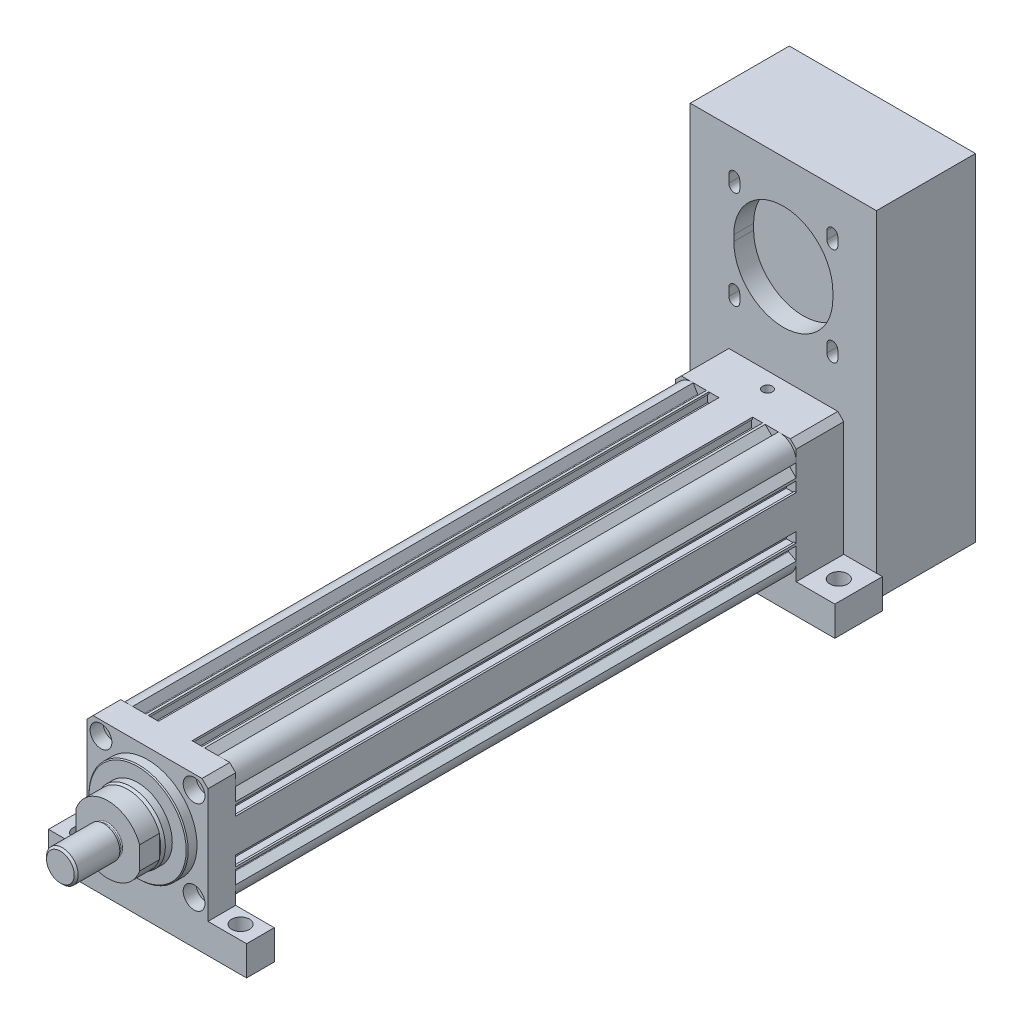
from build123d import *

# Parameters (mm, degrees)
SKETCH_1_R           = 25
SKETCH_1_R_2         = 2.594
EXTRUDE_1_DEPTH      = 283
EXTRUDE_1_2_DEPTH    = 14
SKETCH_3_R           = 4.5
SKETCH_3_R_2         = 3.5
CUT_EXTRUDE_3_DEPTH  = 14
SKETCH_3_5_R         = 5.5
CUT_EXTRUDE_4_DEPTH  = 6.5
SKETCH_5_R           = 25
EXTRUDE_2_DEPTH      = 5
CHAMFER_1_SIZE       = 0.5
SKETCH_6_R           = 17.5
EXTRUDE_3_DEPTH      = 5
CHAMFER_2_SIZE       = 1.5
CHAMFER_2_SIZE2      = 0.8
EXTRUDE_4_DEPTH      = 10
SKETCH_8_R           = 7
EXTRUDE_5_DEPTH      = 2
SKETCH_9_R           = 8
EXTRUDE_6_DEPTH      = 22
CHAMFER_3_SIZE       = 1
FILLET_1_R           = 0.5
SKETCH_10_W          = 61
SKETCH_10_H          = 61
EXTRUDE_7_DEPTH      = 24
SKETCH_26_W          = 94
SKETCH_26_H          = 170
EXTRUDE_11_DEPTH     = 50
CUT_EXTRUDE_11_DEPTH = 10
CUT_EXTRUDE_12_DEPTH = 10
CUT_EXTRUDE_START    = -10
CUT_EXTRUDE_13_DEPTH = 5
SKETCH_28_W          = 100
SKETCH_28_H          = 24
SKETCH_28_R          = 4.5
SKETCH_28_H_2        = 14
EXTRUDE_12_DEPTH     = 15
CHAMFER_4_SIZE       = 3


with BuildPart() as part:
    # Sketch 1 → Extrude 1 (new body)
    with BuildSketch(Plane.XY):
        with BuildLine():
            Line((30.5, 8.5), (29.5, 8.5))
            Line((29.5, 8.5), (29.5, 7.9))
            Line((29.5, 7.9), (25.5, 7.9))
            Line((25.5, 7.9), (25.5, 14.2))
            Line((25.5, 14.2), (29.5, 14.2))
            Line((29.5, 14.2), (29.5, 13.6))
            Line((29.5, 13.6), (30.5, 13.6))
            Line((30.5, 13.6), (30.5, 14.843551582))
            Line((30.5, 14.843551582), (26.602512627, 18.741038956))
            ThreePointArc((26.602512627, 18.741038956), (26.502994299, 19.034210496), (26.675, 19.29163522))
            Line((26.675, 19.29163522), (30.5, 21.5))
            ThreePointArc((30.5, 21.5), (28.010599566, 28.010599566), (21.5, 30.5))
            Line((21.5, 30.5), (19.29163522, 26.675))
            ThreePointArc((19.29163522, 26.675), (19.034210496, 26.502994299), (18.741038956, 26.602512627))
            Line((18.741038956, 26.602512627), (14.843551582, 30.5))
            Line((14.843551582, 30.5), (13.6, 30.5))
            Line((13.6, 30.5), (13.6, 29.5))
            Line((13.6, 29.5), (14.2, 29.5))
            Line((14.2, 29.5), (14.2, 25.5))
            Line((14.2, 25.5), (7.9, 25.5))
            Line((7.9, 25.5), (7.9, 29.5))
            Line((7.9, 29.5), (8.5, 29.5))
            Line((8.5, 29.5), (8.5, 30.5))
            Line((8.5, 30.5), (-8.5, 30.5))
            Line((-8.5, 30.5), (-8.5, 29.5))
            Line((-8.5, 29.5), (-7.9, 29.5))
            Line((-7.9, 29.5), (-7.9, 25.5))
            Line((-7.9, 25.5), (-14.2, 25.5))
            Line((-14.2, 25.5), (-14.2, 29.5))
            Line((-14.2, 29.5), (-13.6, 29.5))
            Line((-13.6, 29.5), (-13.6, 30.5))
            Line((-13.6, 30.5), (-14.843551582, 30.5))
            Line((-14.843551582, 30.5), (-18.741038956, 26.602512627))
            ThreePointArc((-18.741038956, 26.602512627), (-19.034210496, 26.502994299), (-19.29163522, 26.675))
            Line((-19.29163522, 26.675), (-21.5, 30.5))
            ThreePointArc((-21.5, 30.5), (-28.010599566, 28.010599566), (-30.5, 21.5))
            Line((-30.5, 21.5), (-26.675, 19.29163522))
            ThreePointArc((-26.675, 19.29163522), (-26.502994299, 19.034210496), (-26.602512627, 18.741038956))
            Line((-26.602512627, 18.741038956), (-30.5, 14.843551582))
            Line((-30.5, 14.843551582), (-30.5, 13.6))
            Line((-30.5, 13.6), (-29.5, 13.6))
            Line((-29.5, 13.6), (-29.5, 14.2))
            Line((-29.5, 14.2), (-25.5, 14.2))
            Line((-25.5, 14.2), (-25.5, 7.9))
            Line((-25.5, 7.9), (-29.5, 7.9))
            Line((-29.5, 7.9), (-29.5, 8.5))
            Line((-29.5, 8.5), (-30.5, 8.5))
            Line((-30.5, 8.5), (-30.5, -8.5))
            Line((-30.5, -8.5), (-29.5, -8.5))
            Line((-29.5, -8.5), (-29.5, -7.9))
            Line((-29.5, -7.9), (-25.5, -7.9))
            Line((-25.5, -7.9), (-25.5, -14.2))
            Line((-25.5, -14.2), (-29.5, -14.2))
            Line((-29.5, -14.2), (-29.5, -13.6))
            Line((-29.5, -13.6), (-30.5, -13.6))
            Line((-30.5, -13.6), (-30.5, -14.843551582))
            Line((-30.5, -14.843551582), (-26.602512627, -18.741038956))
            ThreePointArc((-26.602512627, -18.741038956), (-26.502994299, -19.034210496), (-26.675, -19.29163522))
            Line((-26.675, -19.29163522), (-30.5, -21.5))
            ThreePointArc((-30.5, -21.5), (-27.825897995, -28.191225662), (-21, -30.5))
            Line((-21, -30.5), (-18.79163522, -26.675))
            ThreePointArc((-18.79163522, -26.675), (-18.534210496, -26.502994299), (-18.241038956, -26.602512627))
            Line((-18.241038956, -26.602512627), (-14.343551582, -30.5))
            Line((-14.343551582, -30.5), (14.343551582, -30.5))
            Line((14.343551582, -30.5), (18.241038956, -26.602512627))
            ThreePointArc((18.241038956, -26.602512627), (18.534210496, -26.502994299), (18.79163522, -26.675))
            Line((18.79163522, -26.675), (21, -30.5))
            ThreePointArc((21, -30.5), (27.825897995, -28.191225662), (30.5, -21.5))
            Line((30.5, -21.5), (26.675, -19.29163522))
            ThreePointArc((26.675, -19.29163522), (26.502994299, -19.034210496), (26.602512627, -18.741038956))
            Line((26.602512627, -18.741038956), (30.5, -14.843551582))
            Line((30.5, -14.843551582), (30.5, -13.6))
            Line((30.5, -13.6), (29.5, -13.6))
            Line((29.5, -13.6), (29.5, -14.2))
            Line((29.5, -14.2), (25.5, -14.2))
            Line((25.5, -14.2), (25.5, -7.9))
            Line((25.5, -7.9), (29.5, -7.9))
            Line((29.5, -7.9), (29.5, -8.5))
            Line((29.5, -8.5), (30.5, -8.5))
            Line((30.5, -8.5), (30.5, 8.5))
        make_face()
        Circle(SKETCH_1_R, mode=Mode.SUBTRACT)
        with Locations((23.5, -23.5)):
            Circle(SKETCH_1_R_2, mode=Mode.SUBTRACT)
        with Locations((-23.5, -23.5)):
            Circle(SKETCH_1_R_2, mode=Mode.SUBTRACT)
        with Locations((23.5, 23.5)):
            Circle(SKETCH_1_R_2, mode=Mode.SUBTRACT)
        with Locations((-23.5, 23.5)):
            Circle(SKETCH_1_R_2, mode=Mode.SUBTRACT)
        with BuildLine():
            Line((-14.843484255, -26.551505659), (-5.699422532, -26.551505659))
            ThreePointArc((-5.699422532, -26.551505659), (-5.401016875, -26.282393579), (-5.637974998, -25.957866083))
            ThreePointArc((-5.637974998, -25.957866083), (-10.496775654, -24.470016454), (-15.006657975, -22.128520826))
            ThreePointArc((-15.006657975, -22.128520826), (-15.31244973, -22.117932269), (-15.468484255, -22.381131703))
            Line((-15.468484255, -22.381131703), (-15.468484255, -25.926505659))
            Line((-15.468484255, -25.926505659), (-14.843484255, -26.551505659))
        make_face(mode=Mode.SUBTRACT)
        with BuildLine():
            Line((15.037740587, -26.551505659), (5.893678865, -26.551505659))
            ThreePointArc((5.893678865, -26.551505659), (5.595273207, -26.282393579), (5.832231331, -25.957866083))
            ThreePointArc((5.832231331, -25.957866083), (10.691031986, -24.470016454), (15.200914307, -22.128520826))
            ThreePointArc((15.200914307, -22.128520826), (15.506706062, -22.117932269), (15.662740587, -22.381131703))
            Line((15.662740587, -22.381131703), (15.662740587, -25.926505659))
            Line((15.662740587, -25.926505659), (15.037740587, -26.551505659))
        make_face(mode=Mode.SUBTRACT)
        with BuildLine():
            Line((24.057261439, -13.884764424), (23.358946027, -13.481591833))
            ThreePointArc((23.358946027, -13.481591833), (23.055418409, -13.441631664), (22.812535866, -13.628001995))
            Line((22.812535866, -13.628001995), (21.480305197, -15.935493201))
            ThreePointArc((21.480305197, -15.935493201), (21.440345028, -16.239020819), (21.626715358, -16.481903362))
            Line((21.626715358, -16.481903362), (22.892186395, -17.212523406))
            ThreePointArc((22.892186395, -17.212523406), (23.195714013, -17.252483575), (23.438596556, -17.066113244))
            Line((23.438596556, -17.066113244), (24.274264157, -15.618694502))
            ThreePointArc((24.274264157, -15.618694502), (24.317966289, -15.507082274), (24.326638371, -15.387533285))
            Line((24.326638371, -15.387533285), (24.223757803, -14.070923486))
            ThreePointArc((24.223757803, -14.070923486), (24.155411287, -13.964516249), (24.057261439, -13.884764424))
        make_face(mode=Mode.SUBTRACT)
        with BuildLine():
            Line((-24.057261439, -13.884764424), (-23.358946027, -13.481591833))
            ThreePointArc((-23.358946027, -13.481591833), (-23.055418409, -13.441631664), (-22.812535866, -13.628001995))
            Line((-22.812535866, -13.628001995), (-21.480305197, -15.935493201))
            ThreePointArc((-21.480305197, -15.935493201), (-21.440345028, -16.239020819), (-21.626715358, -16.481903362))
            Line((-21.626715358, -16.481903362), (-22.892186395, -17.212523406))
            ThreePointArc((-22.892186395, -17.212523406), (-23.195714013, -17.252483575), (-23.438596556, -17.066113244))
            Line((-23.438596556, -17.066113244), (-24.274264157, -15.618694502))
            ThreePointArc((-24.274264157, -15.618694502), (-24.317966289, -15.507082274), (-24.326638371, -15.387533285))
            Line((-24.326638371, -15.387533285), (-24.223757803, -14.070923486))
            ThreePointArc((-24.223757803, -14.070923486), (-24.155411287, -13.964516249), (-24.057261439, -13.884764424))
        make_face(mode=Mode.SUBTRACT)
        with BuildLine():
            Line((24.057261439, 13.884764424), (23.358946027, 13.481591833))
            ThreePointArc((23.358946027, 13.481591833), (23.055418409, 13.441631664), (22.812535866, 13.628001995))
            Line((22.812535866, 13.628001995), (21.480305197, 15.935493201))
            ThreePointArc((21.480305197, 15.935493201), (21.440345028, 16.239020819), (21.626715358, 16.481903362))
            Line((21.626715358, 16.481903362), (22.892186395, 17.212523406))
            ThreePointArc((22.892186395, 17.212523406), (23.195714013, 17.252483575), (23.438596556, 17.066113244))
            Line((23.438596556, 17.066113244), (24.274264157, 15.618694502))
            ThreePointArc((24.274264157, 15.618694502), (24.317966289, 15.507082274), (24.326638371, 15.387533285))
            Line((24.326638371, 15.387533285), (24.223757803, 14.070923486))
            ThreePointArc((24.223757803, 14.070923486), (24.155411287, 13.964516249), (24.057261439, 13.884764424))
        make_face(mode=Mode.SUBTRACT)
        with BuildLine():
            Line((-24.057261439, 13.884764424), (-23.358946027, 13.481591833))
            ThreePointArc((-23.358946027, 13.481591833), (-23.055418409, 13.441631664), (-22.812535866, 13.628001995))
            Line((-22.812535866, 13.628001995), (-21.480305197, 15.935493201))
            ThreePointArc((-21.480305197, 15.935493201), (-21.440345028, 16.239020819), (-21.626715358, 16.481903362))
            Line((-21.626715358, 16.481903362), (-22.892186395, 17.212523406))
            ThreePointArc((-22.892186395, 17.212523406), (-23.195714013, 17.252483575), (-23.438596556, 17.066113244))
            Line((-23.438596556, 17.066113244), (-24.274264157, 15.618694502))
            ThreePointArc((-24.274264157, 15.618694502), (-24.317966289, 15.507082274), (-24.326638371, 15.387533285))
            Line((-24.326638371, 15.387533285), (-24.223757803, 14.070923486))
            ThreePointArc((-24.223757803, 14.070923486), (-24.155411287, 13.964516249), (-24.057261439, 13.884764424))
        make_face(mode=Mode.SUBTRACT)
        with BuildLine():
            Line((17.761634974, 23.75411276), (17.07315308, 24.68624059))
            ThreePointArc((17.07315308, 24.68624059), (16.934629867, 24.812286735), (16.758415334, 24.87572765))
            Line((16.758415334, 24.87572765), (13.966108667, 25.295529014))
            ThreePointArc((13.966108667, 25.295529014), (13.689318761, 25.25468305), (13.482325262, 25.066441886))
            Line((13.482325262, 25.066441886), (12.839111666, 23.986237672))
            ThreePointArc((12.839111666, 23.986237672), (12.785382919, 23.626185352), (12.999780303, 23.331977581))
            ThreePointArc((12.999780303, 23.331977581), (14.833000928, 22.112125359), (16.576342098, 20.766949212))
            ThreePointArc((16.576342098, 20.766949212), (17.053890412, 20.688035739), (17.357364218, 21.065107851))
            Line((17.357364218, 21.065107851), (17.761634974, 23.75411276))
        make_face(mode=Mode.SUBTRACT)
        with BuildLine():
            Line((-17.761634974, 23.75411276), (-17.07315308, 24.68624059))
            ThreePointArc((-17.07315308, 24.68624059), (-16.934629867, 24.812286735), (-16.758415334, 24.87572765))
            Line((-16.758415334, 24.87572765), (-13.966108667, 25.295529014))
            ThreePointArc((-13.966108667, 25.295529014), (-13.689318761, 25.25468305), (-13.482325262, 25.066441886))
            Line((-13.482325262, 25.066441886), (-12.839111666, 23.986237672))
            ThreePointArc((-12.839111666, 23.986237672), (-12.785382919, 23.626185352), (-12.999780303, 23.331977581))
            ThreePointArc((-12.999780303, 23.331977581), (-14.833000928, 22.112125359), (-16.576342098, 20.766949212))
            ThreePointArc((-16.576342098, 20.766949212), (-17.053890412, 20.688035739), (-17.357364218, 21.065107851))
            Line((-17.357364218, 21.065107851), (-17.761634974, 23.75411276))
        make_face(mode=Mode.SUBTRACT)
    extrude(amount=EXTRUDE_1_DEPTH)

    # Sketch 10 → Extrude 7 (add)
    with BuildSketch(Plane(origin=(0, 0, 0), x_dir=(-1, 0, 0), z_dir=(0, 0, -1))):
        Rectangle(SKETCH_10_W, SKETCH_10_H)
    extrude(amount=EXTRUDE_7_DEPTH)

    # Sketch 15 → Hole Wizard M6 _1 (revolve, cut)
    with BuildSketch(Plane(origin=(0, 30.5, -16), x_dir=(0, 0, 1), z_dir=(1, 0, 0))):
        Polygon((0, 0), (0, 9.502151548), (2.5, 8), (2.5, 0), align=None)
    revolve(axis=Axis((0, 36.85, -16), (0, -1, 0)), mode=Mode.SUBTRACT)

    # Sketch 26 → Extrude 11 (add)
    with BuildSketch(Plane(origin=(0, 0, -24), x_dir=(-1, 0, 0), z_dir=(0, 0, -1))):
        with Locations((0, 43)):
            Rectangle(SKETCH_26_W, SKETCH_26_H)
    extrude(amount=EXTRUDE_11_DEPTH)

    # Sketch 27 → Cut-Extrude 11 (cut)
    with BuildSketch(Plane.XY.offset(-24)):
        with BuildLine():
            Line((-25, 81.5), (-24.999999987, 78.49920032))
            ThreePointArc((-24.999999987, 78.49920032), (0.00039984, 53.500000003), (25, 78.5))
            Line((25, 78.5), (25, 81.5))
            ThreePointArc((25, 81.5), (0, 106.5), (-25, 81.5))
        make_face()
    extrude(amount=-CUT_EXTRUDE_11_DEPTH, mode=Mode.SUBTRACT)

    # Sketch 27_3 → Cut-Extrude 12 (cut)
    with BuildSketch(Plane.XY.offset(-24)):
        with BuildLine():
            Line((-27.498737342, 102.748737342), (-27.498737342, 106.748737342))
            ThreePointArc((-27.498737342, 106.748737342), (-24.748737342, 109.498737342), (-21.998737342, 106.748737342))
            Line((-21.998737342, 106.748737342), (-21.998737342, 102.748737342))
            ThreePointArc((-21.998737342, 102.748737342), (-24.748737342, 99.998737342), (-27.498737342, 102.748737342))
        make_face()
        with BuildLine():
            Line((27.498737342, 102.748737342), (27.498737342, 106.748737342))
            ThreePointArc((27.498737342, 106.748737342), (24.748737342, 109.498737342), (21.998737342, 106.748737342))
            Line((21.998737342, 106.748737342), (21.998737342, 102.748737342))
            ThreePointArc((21.998737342, 102.748737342), (24.748737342, 99.998737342), (27.498737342, 102.748737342))
        make_face()
        with BuildLine():
            Line((27.498737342, 57.251262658), (27.498737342, 53.251262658))
            ThreePointArc((27.498737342, 53.251262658), (24.748737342, 50.501262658), (21.998737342, 53.251262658))
            Line((21.998737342, 53.251262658), (21.998737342, 57.251262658))
            ThreePointArc((21.998737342, 57.251262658), (24.748737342, 60.001262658), (27.498737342, 57.251262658))
        make_face()
        with BuildLine():
            Line((-27.498737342, 57.251262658), (-27.498737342, 53.251262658))
            ThreePointArc((-27.498737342, 53.251262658), (-24.748737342, 50.501262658), (-21.998737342, 53.251262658))
            Line((-21.998737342, 53.251262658), (-21.998737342, 57.251262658))
            ThreePointArc((-21.998737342, 57.251262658), (-24.748737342, 60.001262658), (-27.498737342, 57.251262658))
        make_face()
    extrude(amount=-CUT_EXTRUDE_12_DEPTH, mode=Mode.SUBTRACT)

    # Sketch 27_4 → Cut-Extrude 13 (cut)
    with BuildSketch(Plane.XY.offset(-24).offset(CUT_EXTRUDE_START)):
        with BuildLine():
            Line((-28.848737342, 101.848737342), (-28.848737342, 107.648737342))
            ThreePointArc((-28.848737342, 107.648737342), (-24.748737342, 111.748737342), (-20.648737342, 107.648737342))
            Line((-20.648737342, 107.648737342), (-20.648737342, 101.848737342))
            ThreePointArc((-20.648737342, 101.848737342), (-24.748737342, 97.748737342), (-28.848737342, 101.848737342))
        make_face()
        with BuildLine():
            Line((28.848737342, 101.848737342), (28.848737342, 107.648737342))
            ThreePointArc((28.848737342, 107.648737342), (24.748737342, 111.748737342), (20.648737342, 107.648737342))
            Line((20.648737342, 107.648737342), (20.648737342, 101.848737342))
            ThreePointArc((20.648737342, 101.848737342), (24.748737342, 97.748737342), (28.848737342, 101.848737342))
        make_face()
        with BuildLine():
            Line((28.848737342, 58.151262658), (28.848737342, 52.351262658))
            ThreePointArc((28.848737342, 52.351262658), (24.748737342, 48.251262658), (20.648737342, 52.351262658))
            Line((20.648737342, 52.351262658), (20.648737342, 58.151262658))
            ThreePointArc((20.648737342, 58.151262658), (24.748737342, 62.251262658), (28.848737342, 58.151262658))
        make_face()
        with BuildLine():
            Line((-28.848737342, 58.151262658), (-28.848737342, 52.351262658))
            ThreePointArc((-28.848737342, 52.351262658), (-24.748737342, 48.251262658), (-20.648737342, 52.351262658))
            Line((-20.648737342, 52.351262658), (-20.648737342, 58.151262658))
            ThreePointArc((-20.648737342, 58.151262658), (-24.748737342, 62.251262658), (-28.848737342, 58.151262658))
        make_face()
    extrude(amount=-CUT_EXTRUDE_13_DEPTH, mode=Mode.SUBTRACT)



with BuildPart() as body_2:
    # Sketch 2 → Extrude 1 2 (new body)
    with BuildSketch(Plane.XY.offset(283)):
        Polygon((-27.5, 30.5), (-30.5, 27.5), (-30.5, -27.5), (-30.5, -30.5), (-27.5, -30.5), (27.5, -30.5), (30.5, -30.5), (30.5, -27.5), (30.5, 27.5), (27.5, 30.5), align=None)
    extrude(amount=EXTRUDE_1_2_DEPTH)

    # Sketch 3 → Cut-Extrude 3 (cut)
    with BuildSketch(Plane.XY.offset(297)):
        with Locations((-40, -20)):
            Circle(SKETCH_3_R)
        with Locations((-23.5, -23.5)):
            Circle(SKETCH_3_R_2)
        with Locations((-23.5, 23.5)):
            Circle(SKETCH_3_R_2)
        with Locations((23.5, 23.5)):
            Circle(SKETCH_3_R_2)
        with Locations((40, 20)):
            Circle(SKETCH_3_R)
        with Locations((40, -20)):
            Circle(SKETCH_3_R)
        with Locations((23.5, -23.5)):
            Circle(SKETCH_3_R_2)
        with Locations((-40, 20)):
            Circle(SKETCH_3_R)
    extrude(amount=-CUT_EXTRUDE_3_DEPTH, mode=Mode.SUBTRACT)

    # Sketch 3_5 → Cut-Extrude 4 (cut)
    with BuildSketch(Plane.XY.offset(297)):
        with Locations((-23.5, 23.5)):
            Circle(SKETCH_3_5_R)
        with Locations((-23.5, -23.5)):
            Circle(SKETCH_3_5_R)
        with Locations((23.5, -23.5)):
            Circle(SKETCH_3_5_R)
        with Locations((23.5, 23.5)):
            Circle(SKETCH_3_5_R)
    extrude(amount=-CUT_EXTRUDE_4_DEPTH, mode=Mode.SUBTRACT)

    # Sketch 5 → Extrude 2 (add)
    with BuildSketch(Plane.XY.offset(297)):
        Circle(SKETCH_5_R)
    extrude(amount=EXTRUDE_2_DEPTH)

    # Chamfer 1
    chamfer_1_edges = [body_2.edges().sort_by_distance(p)[0] for p in [
        (-25, 0, 302),
    ]]
    chamfer(chamfer_1_edges, length=CHAMFER_1_SIZE)

    # Sketch 6 → Extrude 3 (add)
    with BuildSketch(Plane.XY.offset(302)):
        Circle(SKETCH_6_R)
    extrude(amount=EXTRUDE_3_DEPTH)

    # Chamfer 2
    chamfer_2_edges = [body_2.edges().sort_by_distance(p)[0] for p in [
        (-17.5, 0, 307),
    ]]
    chamfer_2_side = [body_2.faces().sort_by_distance(p)[0] for p in [
        (-17.5, 0, 304.5),
    ]]
    chamfer(chamfer_2_edges, length=CHAMFER_2_SIZE, length2=CHAMFER_2_SIZE2, reference=chamfer_2_side[0])

    # Sketch 7 → Extrude 4 (add)
    with BuildSketch(Plane.XY.offset(307)):
        with BuildLine():
            Line((-16, 5.744562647), (-16, -5.744562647))
            ThreePointArc((-16, -5.744562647), (0, -17), (16, -5.744562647))
            Line((16, -5.744562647), (16, 5.744562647))
            ThreePointArc((16, 5.744562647), (0, 17), (-16, 5.744562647))
        make_face()
    extrude(amount=EXTRUDE_4_DEPTH)

    # Sketch 8 → Extrude 5 (add)
    with BuildSketch(Plane.XY.offset(317)):
        Circle(SKETCH_8_R)
    extrude(amount=EXTRUDE_5_DEPTH)

    # Sketch 9 → Extrude 6 (add)
    with BuildSketch(Plane.XY.offset(319)):
        Circle(SKETCH_9_R)
    extrude(amount=EXTRUDE_6_DEPTH)

    # Chamfer 3
    chamfer_3_edges = [body_2.edges().sort_by_distance(p)[0] for p in [
        (-8, 0, 341),
    ]]
    chamfer(chamfer_3_edges, length=CHAMFER_3_SIZE)

    # Fillet 1
    fillet_1_edges = [body_2.edges().sort_by_distance(p)[0] for p in [
        (-7, 0, 317),
    ]]
    fillet(fillet_1_edges, radius=FILLET_1_R)


with BuildPart() as part_1:
    add(part.part)

    add(body_2.part)  # Extrude 12 merges body 2
    # Sketch 28 → Extrude 12 (add)
    # profile 1 of 2: a face of its own
    with BuildSketch(Plane.XZ.offset(30.5)):
        with Locations((0, -12)):
            Rectangle(SKETCH_28_W, SKETCH_28_H)
        with Locations(Location((-40, -12, 0), (0, 0, 270))):
            Circle(SKETCH_28_R, mode=Mode.SUBTRACT)
        with Locations(Location((40, -12, 0), (0, 0, 270))):
            Circle(SKETCH_28_R, mode=Mode.SUBTRACT)
    # profile 2 of 2: a face of its own
    with BuildSketch(Plane.XZ.offset(30.5)):
        with Locations((0, 290)):
            Rectangle(SKETCH_28_W, SKETCH_28_H_2)
        with Locations(Location((-40, 290, 0), (0, 0, 270))):
            Circle(SKETCH_28_R, mode=Mode.SUBTRACT)
        with Locations(Location((40, 290, 0), (0, 0, 270))):
            Circle(SKETCH_28_R, mode=Mode.SUBTRACT)
    extrude(amount=EXTRUDE_12_DEPTH)

    # Chamfer 4
    chamfer_4_edges = [part_1.edges().sort_by_distance(p)[0] for p in [
        (-30.5, 30.5, -12),
        (30.5, 30.5, -12),
    ]]
    chamfer(chamfer_4_edges, length=CHAMFER_4_SIZE)


solid = part_1.part
